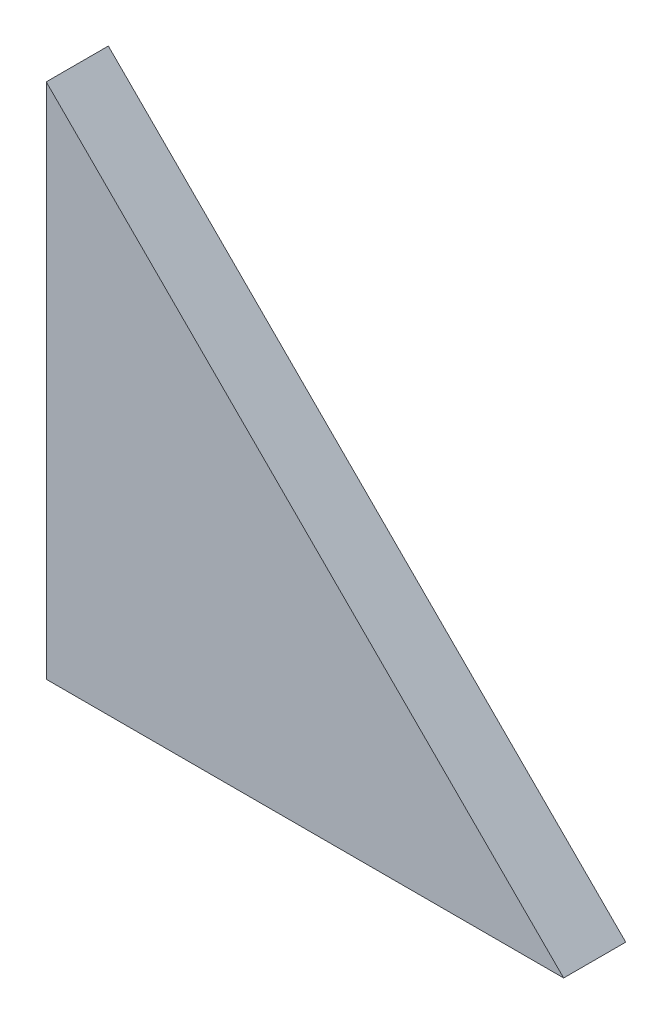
ISO-10303-21;
HEADER;
FILE_DESCRIPTION(('STEP AP214'),'2;1');
FILE_NAME('part.step','',(''),(''),'','','');
FILE_SCHEMA(('AUTOMOTIVE_DESIGN { 1 0 10303 214 1 1 1 1 }'));
ENDSEC;
DATA;
#1=APPLICATION_CONTEXT('core data for automotive mechanical design processes');
#2=APPLICATION_PROTOCOL_DEFINITION('international standard','automotive_design',2000,#1);
#3=PRODUCT_CONTEXT('',#1,'mechanical');
#4=PRODUCT('Part','Part','',(#3));
#5=PRODUCT_RELATED_PRODUCT_CATEGORY('part','',(#4));
#6=PRODUCT_DEFINITION_FORMATION('','',#4);
#7=PRODUCT_DEFINITION_CONTEXT('part definition',#1,'design');
#8=PRODUCT_DEFINITION('design','',#6,#7);
#9=PRODUCT_DEFINITION_SHAPE('','',#8);
#10=(LENGTH_UNIT() NAMED_UNIT(*) SI_UNIT(.MILLI.,.METRE.));
#11=(NAMED_UNIT(*) PLANE_ANGLE_UNIT() SI_UNIT($,.RADIAN.));
#12=(NAMED_UNIT(*) SI_UNIT($,.STERADIAN.) SOLID_ANGLE_UNIT());
#13=UNCERTAINTY_MEASURE_WITH_UNIT(LENGTH_MEASURE(1.E-05),#10,'distance_accuracy_value','');
#14=(GEOMETRIC_REPRESENTATION_CONTEXT(3) GLOBAL_UNCERTAINTY_ASSIGNED_CONTEXT((#13)) GLOBAL_UNIT_ASSIGNED_CONTEXT((#10,
#11,#12)) REPRESENTATION_CONTEXT('',''));
#15=CARTESIAN_POINT('',(0.,0.,0.));
#16=DIRECTION('',(0.,0.,1.));
#17=DIRECTION('',(1.,0.,0.));
#18=AXIS2_PLACEMENT_3D('',#15,#16,#17);
#19=CARTESIAN_POINT('',(100.,9.76996261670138E-12,12.0000000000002));
#20=DIRECTION('',(0.,1.,0.));
#21=DIRECTION('',(-1.00000000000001,0.,0.));
#22=AXIS2_PLACEMENT_3D('',#19,#20,#21);
#23=PLANE('',#22);
#24=DIRECTION('',(1.00000000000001,0.,0.));
#25=VECTOR('',#24,1.);
#26=CARTESIAN_POINT('',(100.,9.76996261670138E-12,0.));
#27=LINE('',#26,#25);
#28=CARTESIAN_POINT('',(-1.11022302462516E-13,0.,1.17267306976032E-12));
#29=VERTEX_POINT('',#28);
#30=CARTESIAN_POINT('',(100.,9.76996261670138E-12,0.));
#31=VERTEX_POINT('',#30);
#32=EDGE_CURVE('E67',#29,#31,#27,.T.);
#33=ORIENTED_EDGE('',*,*,#32,.T.);
#34=DIRECTION('',(0.,0.,-1.00000000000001));
#35=VECTOR('',#34,1.);
#36=CARTESIAN_POINT('',(100.,9.76996261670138E-12,12.0000000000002));
#37=LINE('',#36,#35);
#38=CARTESIAN_POINT('',(100.,9.76996261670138E-12,12.0000000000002));
#39=VERTEX_POINT('',#38);
#40=EDGE_CURVE('E11',#39,#31,#37,.T.);
#41=ORIENTED_EDGE('',*,*,#40,.F.);
#42=DIRECTION('',(1.00000000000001,0.,0.));
#43=VECTOR('',#42,1.);
#44=CARTESIAN_POINT('',(100.,9.76996261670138E-12,12.0000000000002));
#45=LINE('',#44,#43);
#46=CARTESIAN_POINT('',(-1.11022302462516E-13,0.,12.0000000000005));
#47=VERTEX_POINT('',#46);
#48=EDGE_CURVE('E81',#47,#39,#45,.T.);
#49=ORIENTED_EDGE('',*,*,#48,.F.);
#50=DIRECTION('',(0.,0.,-1.00000000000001));
#51=VECTOR('',#50,1.);
#52=CARTESIAN_POINT('',(-1.11022302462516E-13,0.,12.0000000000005));
#53=LINE('',#52,#51);
#54=EDGE_CURVE('E77',#47,#29,#53,.T.);
#55=ORIENTED_EDGE('',*,*,#54,.T.);
#56=EDGE_LOOP('',(#33,#41,#49,#55));
#57=FACE_BOUND('',#56,.T.);
#58=ADVANCED_FACE('F31',(#57),#23,.F.);
#59=CARTESIAN_POINT('',(-1.11022302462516E-13,100.000000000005,12.));
#60=DIRECTION('',(-0.707106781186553,-0.707106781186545,0.));
#61=DIRECTION('',(0.707106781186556,-0.70710678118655,0.));
#62=AXIS2_PLACEMENT_3D('',#59,#60,#61);
#63=PLANE('',#62);
#64=DIRECTION('',(-0.707106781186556,0.70710678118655,0.));
#65=VECTOR('',#64,1.);
#66=CARTESIAN_POINT('',(-2.77555756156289E-13,100.000000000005,-8.11850586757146E-13));
#67=LINE('',#66,#65);
#68=CARTESIAN_POINT('',(-2.77555756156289E-13,100.000000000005,-8.11850586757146E-13));
#69=VERTEX_POINT('',#68);
#70=EDGE_CURVE('E64',#31,#69,#67,.T.);
#71=ORIENTED_EDGE('',*,*,#70,.T.);
#72=DIRECTION('',(0.,0.,-1.00000000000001));
#73=VECTOR('',#72,1.);
#74=CARTESIAN_POINT('',(-1.11022302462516E-13,100.000000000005,12.));
#75=LINE('',#74,#73);
#76=CARTESIAN_POINT('',(-1.11022302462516E-13,100.000000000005,12.));
#77=VERTEX_POINT('',#76);
#78=EDGE_CURVE('E38',#77,#69,#75,.T.);
#79=ORIENTED_EDGE('',*,*,#78,.F.);
#80=DIRECTION('',(-0.707106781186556,0.70710678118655,0.));
#81=VECTOR('',#80,1.);
#82=CARTESIAN_POINT('',(-1.11022302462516E-13,100.000000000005,12.));
#83=LINE('',#82,#81);
#84=EDGE_CURVE('E49',#39,#77,#83,.T.);
#85=ORIENTED_EDGE('',*,*,#84,.F.);
#86=ORIENTED_EDGE('',*,*,#40,.T.);
#87=EDGE_LOOP('',(#71,#79,#85,#86));
#88=FACE_BOUND('',#87,.T.);
#89=ADVANCED_FACE('F73',(#88),#63,.F.);
#90=CARTESIAN_POINT('',(-1.11022302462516E-13,0.,12.0000000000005));
#91=DIRECTION('',(1.00000000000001,0.,0.));
#92=DIRECTION('',(0.,0.,-1.00000000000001));
#93=AXIS2_PLACEMENT_3D('',#90,#91,#92);
#94=PLANE('',#93);
#95=DIRECTION('',(0.,-1.,0.));
#96=VECTOR('',#95,1.);
#97=CARTESIAN_POINT('',(-1.11022302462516E-13,0.,1.17267306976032E-12));
#98=LINE('',#97,#96);
#99=EDGE_CURVE('E68',#69,#29,#98,.T.);
#100=ORIENTED_EDGE('',*,*,#99,.T.);
#101=ORIENTED_EDGE('',*,*,#54,.F.);
#102=DIRECTION('',(0.,-1.,0.));
#103=VECTOR('',#102,1.);
#104=CARTESIAN_POINT('',(-1.11022302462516E-13,0.,12.0000000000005));
#105=LINE('',#104,#103);
#106=EDGE_CURVE('E45',#77,#47,#105,.T.);
#107=ORIENTED_EDGE('',*,*,#106,.F.);
#108=ORIENTED_EDGE('',*,*,#78,.T.);
#109=EDGE_LOOP('',(#100,#101,#107,#108));
#110=FACE_BOUND('',#109,.T.);
#111=ADVANCED_FACE('F86',(#110),#94,.F.);
#112=CARTESIAN_POINT('',(-1.11022302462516E-13,0.,12.0000000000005));
#113=DIRECTION('',(0.,0.,-1.00000000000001));
#114=DIRECTION('',(-1.00000000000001,0.,0.));
#115=AXIS2_PLACEMENT_3D('',#112,#113,#114);
#116=PLANE('',#115);
#117=ORIENTED_EDGE('',*,*,#48,.T.);
#118=ORIENTED_EDGE('',*,*,#84,.T.);
#119=ORIENTED_EDGE('',*,*,#106,.T.);
#120=EDGE_LOOP('',(#117,#118,#119));
#121=FACE_BOUND('',#120,.T.);
#122=ADVANCED_FACE('F87',(#121),#116,.F.);
#123=CARTESIAN_POINT('',(-1.11022302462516E-13,0.,1.17267306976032E-12));
#124=DIRECTION('',(0.,0.,-1.00000000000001));
#125=DIRECTION('',(-1.00000000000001,0.,0.));
#126=AXIS2_PLACEMENT_3D('',#123,#124,#125);
#127=PLANE('',#126);
#128=ORIENTED_EDGE('',*,*,#32,.F.);
#129=ORIENTED_EDGE('',*,*,#99,.F.);
#130=ORIENTED_EDGE('',*,*,#70,.F.);
#131=EDGE_LOOP('',(#128,#129,#130));
#132=FACE_BOUND('',#131,.T.);
#133=ADVANCED_FACE('F65',(#132),#127,.T.);
#134=CLOSED_SHELL('',(#58,#89,#111,#122,#133));
#135=MANIFOLD_SOLID_BREP('B2',#134);
#136=ADVANCED_BREP_SHAPE_REPRESENTATION('',(#18,#135),#14);
#137=SHAPE_DEFINITION_REPRESENTATION(#9,#136);
ENDSEC;
END-ISO-10303-21;
